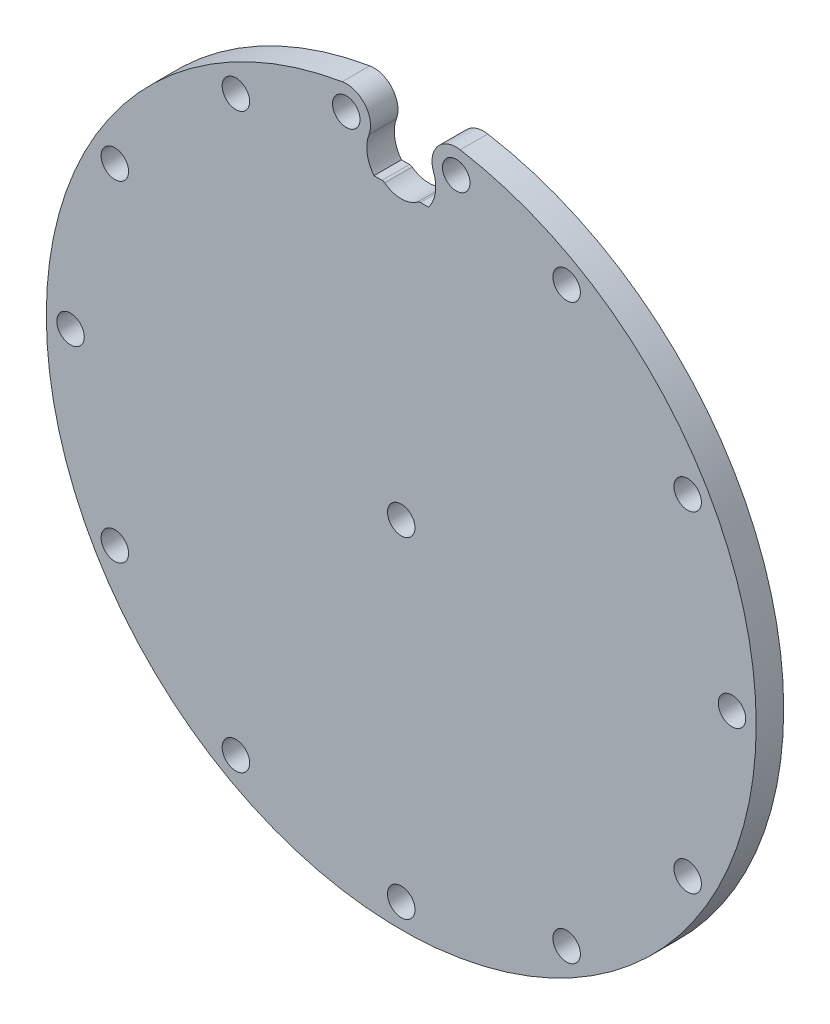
from build123d import *

# Parameters (mm, degrees)
SKETCH2_R           = 1.5875
BOSS_EXTRUDE1_DEPTH = 3.175
FILLET1_R           = 0.5


with BuildPart() as part:
    # Sketch2 → Boss-Extrude1 (new body)
    with BuildSketch(Plane.XY):
        with BuildLine():
            Line((2.043459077, 32.862411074), (3.152062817, 32.862411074))
            ThreePointArc((3.152062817, 32.862411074), (3.935695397, 34.700210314), (3.727581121, 36.687236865))
            ThreePointArc((3.727581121, 36.687236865), (3.707901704, 38.595514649), (4.915554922, 40.073176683))
            ThreePointArc((4.915554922, 40.073176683), (5.833770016, 40.420521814), (6.815445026, 40.42956479))
            ThreePointArc((6.815445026, 40.42956479), (0, -41), (-6.815445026, 40.42956479))
            ThreePointArc((-6.815445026, 40.42956479), (-5.833770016, 40.420521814), (-4.915554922, 40.073176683))
            ThreePointArc((-4.915554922, 40.073176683), (-3.707901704, 38.595514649), (-3.727581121, 36.687236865))
            ThreePointArc((-3.727581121, 36.687236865), (-3.935695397, 34.700210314), (-3.152062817, 32.862411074))
            Line((-3.152062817, 32.862411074), (-2.043459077, 32.862411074))
            ThreePointArc((-2.043459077, 32.862411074), (0, 32.117411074), (2.043459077, 32.862411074))
        make_face()
        Circle(SKETCH2_R, mode=Mode.SUBTRACT)
        with Locations((-38.2, 0)):
            Circle(SKETCH2_R, mode=Mode.SUBTRACT)
        with Locations((-33.082170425, -19.1)):
            Circle(SKETCH2_R, mode=Mode.SUBTRACT)
        with Locations((-19.1, -33.082170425)):
            Circle(SKETCH2_R, mode=Mode.SUBTRACT)
        with Locations((0, -38.2)):
            Circle(SKETCH2_R, mode=Mode.SUBTRACT)
        with Locations((19.1, -33.082170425)):
            Circle(SKETCH2_R, mode=Mode.SUBTRACT)
        with Locations((33.082170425, -19.1)):
            Circle(SKETCH2_R, mode=Mode.SUBTRACT)
        with Locations((38.2, 0)):
            Circle(SKETCH2_R, mode=Mode.SUBTRACT)
        with Locations((-33.082170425, 19.1)):
            Circle(SKETCH2_R, mode=Mode.SUBTRACT)
        with Locations((-19.1, 33.082170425)):
            Circle(SKETCH2_R, mode=Mode.SUBTRACT)
        with Locations((33.082170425, 19.1)):
            Circle(SKETCH2_R, mode=Mode.SUBTRACT)
        with Locations((19.1, 33.082170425)):
            Circle(SKETCH2_R, mode=Mode.SUBTRACT)
        with Locations((6.35, 37.668521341)):
            Circle(SKETCH2_R, mode=Mode.SUBTRACT)
        with Locations((-6.35, 37.668521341)):
            Circle(SKETCH2_R, mode=Mode.SUBTRACT)
    extrude(amount=BOSS_EXTRUDE1_DEPTH)

    # Fillet1
    fillet1_edges = [part.edges().sort_by_distance(p)[0] for p in [
        (-2.043459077, 32.862411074, 1.5875),
        (2.043459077, 32.862411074, 1.5875),
    ]]
    fillet(fillet1_edges, radius=FILLET1_R)


solid = part.part
